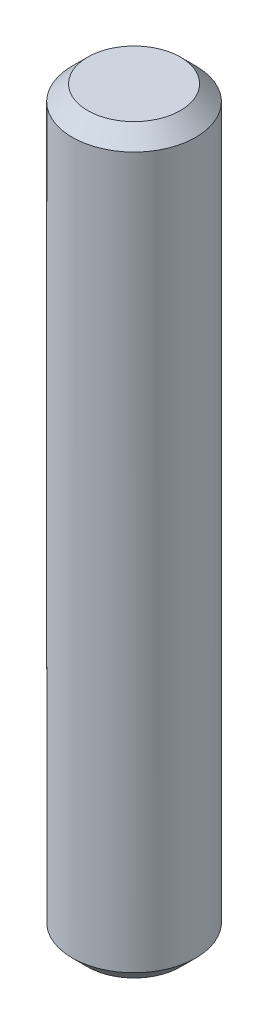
ISO-10303-21;
HEADER;
FILE_DESCRIPTION(('STEP AP214'),'2;1');
FILE_NAME('part.step','',(''),(''),'','','');
FILE_SCHEMA(('AUTOMOTIVE_DESIGN { 1 0 10303 214 1 1 1 1 }'));
ENDSEC;
DATA;
#1=APPLICATION_CONTEXT('core data for automotive mechanical design processes');
#2=APPLICATION_PROTOCOL_DEFINITION('international standard','automotive_design',2000,#1);
#3=PRODUCT_CONTEXT('',#1,'mechanical');
#4=PRODUCT('Part','Part','',(#3));
#5=PRODUCT_RELATED_PRODUCT_CATEGORY('part','',(#4));
#6=PRODUCT_DEFINITION_FORMATION('','',#4);
#7=PRODUCT_DEFINITION_CONTEXT('part definition',#1,'design');
#8=PRODUCT_DEFINITION('design','',#6,#7);
#9=PRODUCT_DEFINITION_SHAPE('','',#8);
#10=(LENGTH_UNIT() NAMED_UNIT(*) SI_UNIT(.MILLI.,.METRE.));
#11=(NAMED_UNIT(*) PLANE_ANGLE_UNIT() SI_UNIT($,.RADIAN.));
#12=(NAMED_UNIT(*) SI_UNIT($,.STERADIAN.) SOLID_ANGLE_UNIT());
#13=UNCERTAINTY_MEASURE_WITH_UNIT(LENGTH_MEASURE(1.E-05),#10,'distance_accuracy_value','');
#14=(GEOMETRIC_REPRESENTATION_CONTEXT(3) GLOBAL_UNCERTAINTY_ASSIGNED_CONTEXT((#13)) GLOBAL_UNIT_ASSIGNED_CONTEXT((#10,
#11,#12)) REPRESENTATION_CONTEXT('',''));
#15=CARTESIAN_POINT('',(0.,0.,0.));
#16=DIRECTION('',(0.,0.,1.));
#17=DIRECTION('',(1.,0.,0.));
#18=AXIS2_PLACEMENT_3D('',#15,#16,#17);
#19=CARTESIAN_POINT('',(0.,152.4,0.));
#20=DIRECTION('',(0.,-1.,0.));
#21=DIRECTION('',(0.,0.,-1.));
#22=AXIS2_PLACEMENT_3D('',#19,#20,#21);
#23=CYLINDRICAL_SURFACE('',#22,25.4);
#24=CARTESIAN_POINT('',(0.,-146.05,0.));
#25=DIRECTION('',(0.,1.,0.));
#26=DIRECTION('',(0.,0.,1.));
#27=AXIS2_PLACEMENT_3D('',#24,#25,#26);
#28=CIRCLE('',#27,25.4);
#29=CARTESIAN_POINT('',(0.,-146.05,-25.4));
#30=VERTEX_POINT('',#29);
#31=EDGE_CURVE('E42',#30,#30,#28,.T.);
#32=CARTESIAN_POINT('',(0.,146.05,0.));
#33=DIRECTION('',(0.,1.,0.));
#34=DIRECTION('',(0.,0.,1.));
#35=AXIS2_PLACEMENT_3D('',#32,#33,#34);
#36=CIRCLE('',#35,25.4);
#37=CARTESIAN_POINT('',(0.,146.05,-25.4));
#38=VERTEX_POINT('',#37);
#39=EDGE_CURVE('E46',#38,#38,#36,.F.);
#40=CARTESIAN_POINT('',(0.,-146.05,-25.4));
#41=CARTESIAN_POINT('',(0.,-143.007291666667,-25.4));
#42=CARTESIAN_POINT('',(0.,-139.964583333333,-25.4));
#43=CARTESIAN_POINT('',(0.,-133.879166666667,-25.4));
#44=CARTESIAN_POINT('',(0.,-130.836458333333,-25.4));
#45=CARTESIAN_POINT('',(0.,-124.751041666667,-25.4));
#46=CARTESIAN_POINT('',(0.,-121.708333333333,-25.4));
#47=CARTESIAN_POINT('',(0.,-115.622916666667,-25.4));
#48=CARTESIAN_POINT('',(0.,-112.580208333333,-25.4));
#49=CARTESIAN_POINT('',(0.,-106.494791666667,-25.4));
#50=CARTESIAN_POINT('',(0.,-103.452083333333,-25.4));
#51=CARTESIAN_POINT('',(0.,-97.3666666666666,-25.4));
#52=CARTESIAN_POINT('',(0.,-94.3239583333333,-25.4));
#53=CARTESIAN_POINT('',(0.,-88.2385416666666,-25.4));
#54=CARTESIAN_POINT('',(0.,-85.1958333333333,-25.4));
#55=CARTESIAN_POINT('',(0.,-79.1104166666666,-25.4));
#56=CARTESIAN_POINT('',(0.,-76.0677083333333,-25.4));
#57=CARTESIAN_POINT('',(0.,-69.9822916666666,-25.4));
#58=CARTESIAN_POINT('',(0.,-66.9395833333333,-25.4));
#59=CARTESIAN_POINT('',(0.,-60.8541666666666,-25.4));
#60=CARTESIAN_POINT('',(0.,-57.8114583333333,-25.4));
#61=CARTESIAN_POINT('',(0.,-51.7260416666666,-25.4));
#62=CARTESIAN_POINT('',(0.,-48.6833333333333,-25.4));
#63=CARTESIAN_POINT('',(0.,-42.5979166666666,-25.4));
#64=CARTESIAN_POINT('',(0.,-39.5552083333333,-25.4));
#65=CARTESIAN_POINT('',(0.,-33.4697916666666,-25.4));
#66=CARTESIAN_POINT('',(0.,-30.4270833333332,-25.4));
#67=CARTESIAN_POINT('',(0.,-24.3416666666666,-25.4));
#68=CARTESIAN_POINT('',(0.,-21.2989583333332,-25.4));
#69=CARTESIAN_POINT('',(0.,-15.2135416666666,-25.4));
#70=CARTESIAN_POINT('',(0.,-12.1708333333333,-25.4));
#71=CARTESIAN_POINT('',(0.,-6.08541666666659,-25.4));
#72=CARTESIAN_POINT('',(0.,-3.04270833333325,-25.4));
#73=CARTESIAN_POINT('',(0.,3.04270833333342,-25.4));
#74=CARTESIAN_POINT('',(0.,6.08541666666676,-25.4));
#75=CARTESIAN_POINT('',(0.,12.1708333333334,-25.4));
#76=CARTESIAN_POINT('',(0.,15.2135416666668,-25.4));
#77=CARTESIAN_POINT('',(0.,21.2989583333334,-25.4));
#78=CARTESIAN_POINT('',(0.,24.3416666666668,-25.4));
#79=CARTESIAN_POINT('',(0.,30.4270833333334,-25.4));
#80=CARTESIAN_POINT('',(0.,33.4697916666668,-25.4));
#81=CARTESIAN_POINT('',(0.,39.5552083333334,-25.4));
#82=CARTESIAN_POINT('',(0.,42.5979166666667,-25.4));
#83=CARTESIAN_POINT('',(0.,48.6833333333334,-25.4));
#84=CARTESIAN_POINT('',(0.,51.7260416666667,-25.4));
#85=CARTESIAN_POINT('',(0.,57.8114583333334,-25.4));
#86=CARTESIAN_POINT('',(0.,60.8541666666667,-25.4));
#87=CARTESIAN_POINT('',(0.,66.9395833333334,-25.4));
#88=CARTESIAN_POINT('',(0.,69.9822916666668,-25.4));
#89=CARTESIAN_POINT('',(0.,76.0677083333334,-25.4));
#90=CARTESIAN_POINT('',(0.,79.1104166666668,-25.4));
#91=CARTESIAN_POINT('',(0.,85.1958333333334,-25.4));
#92=CARTESIAN_POINT('',(0.,88.2385416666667,-25.4));
#93=CARTESIAN_POINT('',(0.,94.3239583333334,-25.4));
#94=CARTESIAN_POINT('',(0.,97.3666666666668,-25.4));
#95=CARTESIAN_POINT('',(0.,103.452083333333,-25.4));
#96=CARTESIAN_POINT('',(0.,106.494791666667,-25.4));
#97=CARTESIAN_POINT('',(0.,112.580208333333,-25.4));
#98=CARTESIAN_POINT('',(0.,115.622916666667,-25.4));
#99=CARTESIAN_POINT('',(0.,121.708333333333,-25.4));
#100=CARTESIAN_POINT('',(0.,124.751041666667,-25.4));
#101=CARTESIAN_POINT('',(0.,130.836458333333,-25.4));
#102=CARTESIAN_POINT('',(0.,133.879166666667,-25.4));
#103=CARTESIAN_POINT('',(0.,139.964583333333,-25.4));
#104=CARTESIAN_POINT('',(0.,143.007291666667,-25.4));
#105=CARTESIAN_POINT('',(0.,146.05,-25.4));
#106=B_SPLINE_CURVE_WITH_KNOTS('',3,(#40,#41,#42,#43,#44,#45,#46,#47,#48,#49,#50,#51,#52,#53,
#54,#55,#56,#57,#58,#59,#60,#61,#62,#63,#64,#65,#66,#67,#68,#69,#70,#71,#72,#73,#74,#75,#76,#77,
#78,#79,#80,#81,#82,#83,#84,#85,#86,#87,#88,#89,#90,#91,#92,#93,#94,#95,#96,#97,#98,#99,#100,
#101,#102,#103,#104,#105),.UNSPECIFIED.,.F.,.F.,(4,2,2,2,2,2,2,2,2,2,2,2,2,2,2,2,2,2,2,2,2,2,2,
2,2,2,2,2,2,2,2,2,4),(0.,9.12812499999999,18.25625,27.384375,36.5125,45.640625,54.76875,
63.896875,73.025,82.153125,91.28125,100.409375,109.5375,118.665625,127.79375,136.921875,146.05,
155.178125,164.30625,173.434375,182.5625,191.690625,200.81875,209.946875,219.075,228.203125,
237.33125,246.459375,255.5875,264.715625,273.84375,282.971875,292.1),.UNSPECIFIED.);
#107=EDGE_CURVE('BSEAM31',#30,#38,#106,.T.);
#108=ORIENTED_EDGE('',*,*,#31,.T.);
#109=ORIENTED_EDGE('',*,*,#39,.T.);
#110=ORIENTED_EDGE('',*,*,#107,.T.);
#111=ORIENTED_EDGE('',*,*,#107,.F.);
#112=EDGE_LOOP('',(#108,#110,#109,#111));
#113=FACE_BOUND('',#112,.T.);
#114=ADVANCED_FACE('F31',(#113),#23,.T.);
#115=CARTESIAN_POINT('',(0.,152.4,0.));
#116=DIRECTION('',(0.,1.,0.));
#117=DIRECTION('',(0.,0.,1.));
#118=AXIS2_PLACEMENT_3D('',#115,#116,#117);
#119=PLANE('',#118);
#120=CARTESIAN_POINT('',(0.,152.4,0.));
#121=DIRECTION('',(0.,1.,0.));
#122=DIRECTION('',(0.,0.,1.));
#123=AXIS2_PLACEMENT_3D('',#120,#121,#122);
#124=CIRCLE('',#123,19.0500000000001);
#125=CARTESIAN_POINT('',(0.,152.4,-19.0500000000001));
#126=VERTEX_POINT('',#125);
#127=EDGE_CURVE('E10',#126,#126,#124,.T.);
#128=ORIENTED_EDGE('',*,*,#127,.T.);
#129=EDGE_LOOP('',(#128));
#130=FACE_BOUND('',#129,.T.);
#131=ADVANCED_FACE('F62',(#130),#119,.T.);
#132=CARTESIAN_POINT('',(0.,-152.4,0.));
#133=DIRECTION('',(0.,1.,0.));
#134=DIRECTION('',(0.,0.,1.));
#135=AXIS2_PLACEMENT_3D('',#132,#133,#134);
#136=PLANE('',#135);
#137=CARTESIAN_POINT('',(0.,-152.4,0.));
#138=DIRECTION('',(0.,1.,0.));
#139=DIRECTION('',(0.,0.,1.));
#140=AXIS2_PLACEMENT_3D('',#137,#138,#139);
#141=CIRCLE('',#140,19.0499999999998);
#142=CARTESIAN_POINT('',(0.,-152.4,19.0499999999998));
#143=VERTEX_POINT('',#142);
#144=EDGE_CURVE('E38',#143,#143,#141,.F.);
#145=ORIENTED_EDGE('',*,*,#144,.T.);
#146=EDGE_LOOP('',(#145));
#147=FACE_BOUND('',#146,.T.);
#148=ADVANCED_FACE('F59',(#147),#136,.F.);
#149=CARTESIAN_POINT('',(0.,-146.05,0.));
#150=DIRECTION('',(0.,1.,0.));
#151=DIRECTION('',(0.,0.,1.));
#152=AXIS2_PLACEMENT_3D('',#149,#150,#151);
#153=CONICAL_SURFACE('',#152,25.4,0.785398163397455);
#154=ORIENTED_EDGE('',*,*,#144,.F.);
#155=EDGE_LOOP('',(#154));
#156=FACE_BOUND('',#155,.T.);
#157=ORIENTED_EDGE('',*,*,#31,.F.);
#158=EDGE_LOOP('',(#157));
#159=FACE_BOUND('',#158,.T.);
#160=ADVANCED_FACE('F55',(#156,#159),#153,.T.);
#161=CARTESIAN_POINT('',(0.,152.4,0.));
#162=DIRECTION('',(0.,-1.,0.));
#163=DIRECTION('',(0.,0.,-1.));
#164=AXIS2_PLACEMENT_3D('',#161,#162,#163);
#165=CONICAL_SURFACE('',#164,19.0500000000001,0.785398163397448);
#166=CARTESIAN_POINT('',(0.,146.05,-25.4));
#167=CARTESIAN_POINT('',(0.,146.116145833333,-25.3338541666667));
#168=CARTESIAN_POINT('',(0.,146.182291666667,-25.2677083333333));
#169=CARTESIAN_POINT('',(0.,146.314583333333,-25.1354166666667));
#170=CARTESIAN_POINT('',(0.,146.380729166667,-25.0692708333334));
#171=CARTESIAN_POINT('',(0.,146.513020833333,-24.9369791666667));
#172=CARTESIAN_POINT('',(0.,146.579166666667,-24.8708333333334));
#173=CARTESIAN_POINT('',(0.,146.711458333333,-24.7385416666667));
#174=CARTESIAN_POINT('',(0.,146.777604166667,-24.6723958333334));
#175=CARTESIAN_POINT('',(0.,146.909895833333,-24.5401041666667));
#176=CARTESIAN_POINT('',(0.,146.976041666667,-24.4739583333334));
#177=CARTESIAN_POINT('',(0.,147.108333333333,-24.3416666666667));
#178=CARTESIAN_POINT('',(0.,147.174479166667,-24.2755208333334));
#179=CARTESIAN_POINT('',(0.,147.306770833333,-24.1432291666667));
#180=CARTESIAN_POINT('',(0.,147.372916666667,-24.0770833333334));
#181=CARTESIAN_POINT('',(0.,147.505208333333,-23.9447916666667));
#182=CARTESIAN_POINT('',(0.,147.571354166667,-23.8786458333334));
#183=CARTESIAN_POINT('',(0.,147.703645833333,-23.7463541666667));
#184=CARTESIAN_POINT('',(0.,147.769791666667,-23.6802083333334));
#185=CARTESIAN_POINT('',(0.,147.902083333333,-23.5479166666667));
#186=CARTESIAN_POINT('',(0.,147.968229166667,-23.4817708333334));
#187=CARTESIAN_POINT('',(0.,148.100520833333,-23.3494791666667));
#188=CARTESIAN_POINT('',(0.,148.166666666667,-23.2833333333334));
#189=CARTESIAN_POINT('',(0.,148.298958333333,-23.1510416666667));
#190=CARTESIAN_POINT('',(0.,148.365104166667,-23.0848958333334));
#191=CARTESIAN_POINT('',(0.,148.497395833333,-22.9526041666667));
#192=CARTESIAN_POINT('',(0.,148.563541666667,-22.8864583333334));
#193=CARTESIAN_POINT('',(0.,148.695833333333,-22.7541666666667));
#194=CARTESIAN_POINT('',(0.,148.761979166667,-22.6880208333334));
#195=CARTESIAN_POINT('',(0.,148.894270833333,-22.5557291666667));
#196=CARTESIAN_POINT('',(0.,148.960416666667,-22.4895833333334));
#197=CARTESIAN_POINT('',(0.,149.092708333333,-22.3572916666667));
#198=CARTESIAN_POINT('',(0.,149.158854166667,-22.2911458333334));
#199=CARTESIAN_POINT('',(0.,149.291145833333,-22.1588541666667));
#200=CARTESIAN_POINT('',(0.,149.357291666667,-22.0927083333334));
#201=CARTESIAN_POINT('',(0.,149.489583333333,-21.9604166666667));
#202=CARTESIAN_POINT('',(0.,149.555729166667,-21.8942708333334));
#203=CARTESIAN_POINT('',(0.,149.688020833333,-21.7619791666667));
#204=CARTESIAN_POINT('',(0.,149.754166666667,-21.6958333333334));
#205=CARTESIAN_POINT('',(0.,149.886458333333,-21.5635416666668));
#206=CARTESIAN_POINT('',(0.,149.952604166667,-21.4973958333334));
#207=CARTESIAN_POINT('',(0.,150.084895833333,-21.3651041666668));
#208=CARTESIAN_POINT('',(0.,150.151041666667,-21.2989583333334));
#209=CARTESIAN_POINT('',(0.,150.283333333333,-21.1666666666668));
#210=CARTESIAN_POINT('',(0.,150.349479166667,-21.1005208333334));
#211=CARTESIAN_POINT('',(0.,150.481770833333,-20.9682291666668));
#212=CARTESIAN_POINT('',(0.,150.547916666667,-20.9020833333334));
#213=CARTESIAN_POINT('',(0.,150.680208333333,-20.7697916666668));
#214=CARTESIAN_POINT('',(0.,150.746354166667,-20.7036458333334));
#215=CARTESIAN_POINT('',(0.,150.878645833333,-20.5713541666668));
#216=CARTESIAN_POINT('',(0.,150.944791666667,-20.5052083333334));
#217=CARTESIAN_POINT('',(0.,151.077083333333,-20.3729166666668));
#218=CARTESIAN_POINT('',(0.,151.143229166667,-20.3067708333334));
#219=CARTESIAN_POINT('',(0.,151.275520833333,-20.1744791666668));
#220=CARTESIAN_POINT('',(0.,151.341666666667,-20.1083333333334));
#221=CARTESIAN_POINT('',(0.,151.473958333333,-19.9760416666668));
#222=CARTESIAN_POINT('',(0.,151.540104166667,-19.9098958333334));
#223=CARTESIAN_POINT('',(0.,151.672395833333,-19.7776041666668));
#224=CARTESIAN_POINT('',(0.,151.738541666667,-19.7114583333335));
#225=CARTESIAN_POINT('',(0.,151.870833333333,-19.5791666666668));
#226=CARTESIAN_POINT('',(0.,151.936979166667,-19.5130208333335));
#227=CARTESIAN_POINT('',(0.,152.069270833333,-19.3807291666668));
#228=CARTESIAN_POINT('',(0.,152.135416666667,-19.3145833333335));
#229=CARTESIAN_POINT('',(0.,152.267708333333,-19.1822916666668));
#230=CARTESIAN_POINT('',(0.,152.333854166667,-19.1161458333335));
#231=CARTESIAN_POINT('',(0.,152.4,-19.0500000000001));
#232=B_SPLINE_CURVE_WITH_KNOTS('',3,(#166,#167,#168,#169,#170,#171,#172,#173,#174,#175,#176,
#177,#178,#179,#180,#181,#182,#183,#184,#185,#186,#187,#188,#189,#190,#191,#192,#193,#194,#195,
#196,#197,#198,#199,#200,#201,#202,#203,#204,#205,#206,#207,#208,#209,#210,#211,#212,#213,#214,
#215,#216,#217,#218,#219,#220,#221,#222,#223,#224,#225,#226,#227,#228,#229,#230,#231),
.UNSPECIFIED.,.F.,.F.,(4,2,2,2,2,2,2,2,2,2,2,2,2,2,2,2,2,2,2,2,2,2,2,2,2,2,2,2,2,2,2,2,4),(0.,
0.280633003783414,0.561266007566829,0.841899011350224,1.12253201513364,1.40316501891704,
1.68379802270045,1.96443102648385,2.24506403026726,2.52569703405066,2.80633003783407,
3.08696304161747,3.36759604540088,3.64822904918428,3.92886205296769,4.20949505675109,
4.4901280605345,4.77076106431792,5.05139406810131,5.33202707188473,5.61266007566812,
5.89329307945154,6.17392608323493,6.45455908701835,6.73519209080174,7.01582509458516,
7.29645809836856,7.57709110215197,7.85772410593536,8.13835710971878,8.41899011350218,
8.69962311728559,8.98025612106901),.UNSPECIFIED.);
#233=EDGE_CURVE('BSEAM33',#38,#126,#232,.T.);
#234=ORIENTED_EDGE('',*,*,#39,.F.);
#235=ORIENTED_EDGE('',*,*,#127,.F.);
#236=ORIENTED_EDGE('',*,*,#233,.T.);
#237=ORIENTED_EDGE('',*,*,#233,.F.);
#238=EDGE_LOOP('',(#234,#236,#235,#237));
#239=FACE_BOUND('',#238,.T.);
#240=ADVANCED_FACE('F33',(#239),#165,.T.);
#241=CLOSED_SHELL('',(#114,#131,#148,#160,#240));
#242=MANIFOLD_SOLID_BREP('B2',#241);
#243=ADVANCED_BREP_SHAPE_REPRESENTATION('',(#18,#242),#14);
#244=SHAPE_DEFINITION_REPRESENTATION(#9,#243);
ENDSEC;
END-ISO-10303-21;
